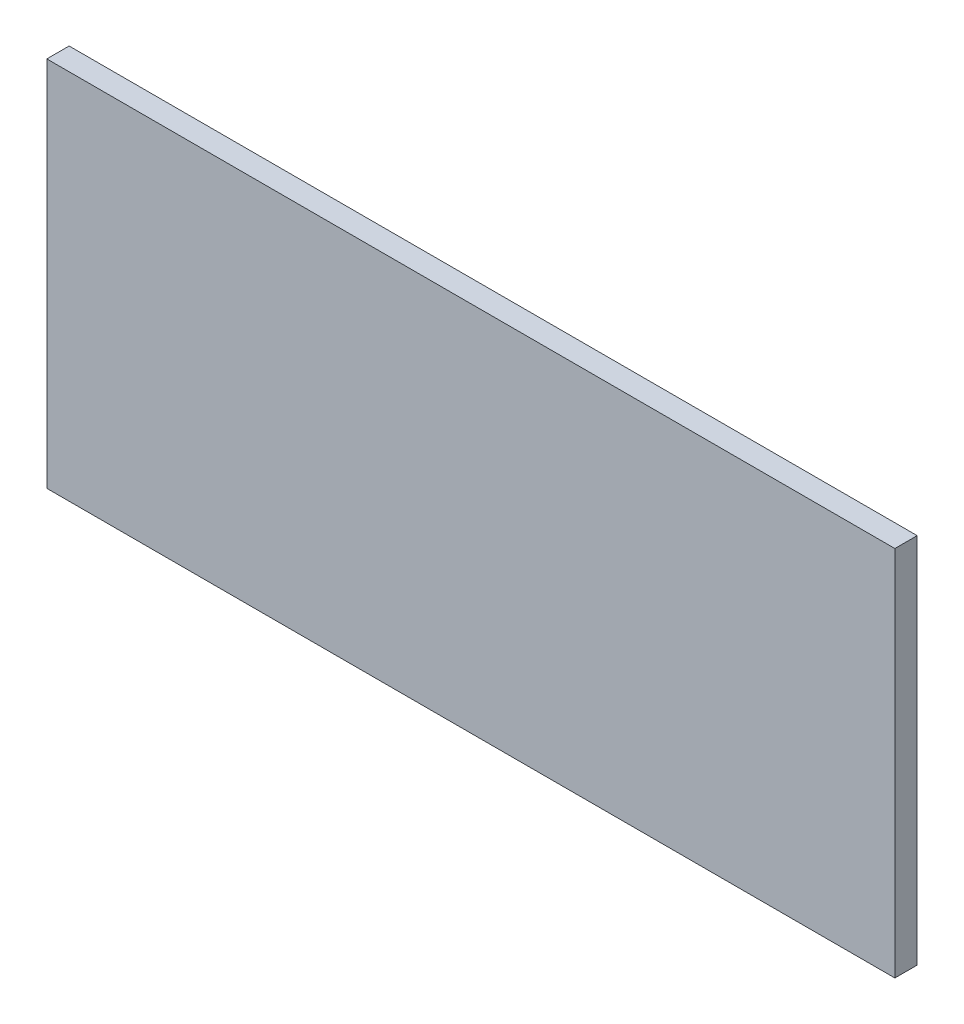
ISO-10303-21;
HEADER;
FILE_DESCRIPTION(('STEP AP214'),'2;1');
FILE_NAME('part.step','',(''),(''),'','','');
FILE_SCHEMA(('AUTOMOTIVE_DESIGN { 1 0 10303 214 1 1 1 1 }'));
ENDSEC;
DATA;
#1=APPLICATION_CONTEXT('core data for automotive mechanical design processes');
#2=APPLICATION_PROTOCOL_DEFINITION('international standard','automotive_design',2000,#1);
#3=PRODUCT_CONTEXT('',#1,'mechanical');
#4=PRODUCT('Part','Part','',(#3));
#5=PRODUCT_RELATED_PRODUCT_CATEGORY('part','',(#4));
#6=PRODUCT_DEFINITION_FORMATION('','',#4);
#7=PRODUCT_DEFINITION_CONTEXT('part definition',#1,'design');
#8=PRODUCT_DEFINITION('design','',#6,#7);
#9=PRODUCT_DEFINITION_SHAPE('','',#8);
#10=(LENGTH_UNIT() NAMED_UNIT(*) SI_UNIT(.MILLI.,.METRE.));
#11=(NAMED_UNIT(*) PLANE_ANGLE_UNIT() SI_UNIT($,.RADIAN.));
#12=(NAMED_UNIT(*) SI_UNIT($,.STERADIAN.) SOLID_ANGLE_UNIT());
#13=UNCERTAINTY_MEASURE_WITH_UNIT(LENGTH_MEASURE(1.E-05),#10,'distance_accuracy_value','');
#14=(GEOMETRIC_REPRESENTATION_CONTEXT(3) GLOBAL_UNCERTAINTY_ASSIGNED_CONTEXT((#13)) GLOBAL_UNIT_ASSIGNED_CONTEXT((#10,
#11,#12)) REPRESENTATION_CONTEXT('',''));
#15=CARTESIAN_POINT('',(0.,0.,0.));
#16=DIRECTION('',(0.,0.,1.));
#17=DIRECTION('',(1.,0.,0.));
#18=AXIS2_PLACEMENT_3D('',#15,#16,#17);
#19=CARTESIAN_POINT('',(-1.4478,-0.635,0.));
#20=DIRECTION('',(0.,0.,1.));
#21=DIRECTION('',(1.,0.,0.));
#22=AXIS2_PLACEMENT_3D('',#19,#20,#21);
#23=PLANE('',#22);
#24=DIRECTION('',(-1.,0.,0.));
#25=VECTOR('',#24,1.);
#26=CARTESIAN_POINT('',(0.,0.635,0.));
#27=LINE('',#26,#25);
#28=CARTESIAN_POINT('',(1.4478,0.635,0.));
#29=VERTEX_POINT('',#28);
#30=CARTESIAN_POINT('',(-1.4478,0.635,0.));
#31=VERTEX_POINT('',#30);
#32=EDGE_CURVE('E56',#29,#31,#27,.T.);
#33=ORIENTED_EDGE('',*,*,#32,.F.);
#34=DIRECTION('',(0.,1.,0.));
#35=VECTOR('',#34,1.);
#36=CARTESIAN_POINT('',(1.4478,0.,0.));
#37=LINE('',#36,#35);
#38=CARTESIAN_POINT('',(1.4478,-0.635,0.));
#39=VERTEX_POINT('',#38);
#40=EDGE_CURVE('E59',#39,#29,#37,.T.);
#41=ORIENTED_EDGE('',*,*,#40,.F.);
#42=DIRECTION('',(1.,0.,0.));
#43=VECTOR('',#42,1.);
#44=CARTESIAN_POINT('',(0.,-0.635,0.));
#45=LINE('',#44,#43);
#46=CARTESIAN_POINT('',(-1.4478,-0.635,0.));
#47=VERTEX_POINT('',#46);
#48=EDGE_CURVE('E21',#47,#39,#45,.T.);
#49=ORIENTED_EDGE('',*,*,#48,.F.);
#50=DIRECTION('',(0.,-1.,0.));
#51=VECTOR('',#50,1.);
#52=CARTESIAN_POINT('',(-1.4478,0.,0.));
#53=LINE('',#52,#51);
#54=EDGE_CURVE('E71',#31,#47,#53,.T.);
#55=ORIENTED_EDGE('',*,*,#54,.F.);
#56=EDGE_LOOP('',(#33,#41,#49,#55));
#57=FACE_BOUND('',#56,.T.);
#58=ADVANCED_FACE('F17',(#57),#23,.F.);
#59=CARTESIAN_POINT('',(-1.4478,-0.635,0.0762));
#60=DIRECTION('',(0.,-1.,0.));
#61=DIRECTION('',(0.,0.,-1.));
#62=AXIS2_PLACEMENT_3D('',#59,#60,#61);
#63=PLANE('',#62);
#64=DIRECTION('',(0.,0.,1.));
#65=VECTOR('',#64,1.);
#66=CARTESIAN_POINT('',(-1.4478,-0.635,0.0381));
#67=LINE('',#66,#65);
#68=CARTESIAN_POINT('',(-1.4478,-0.635,0.0762));
#69=VERTEX_POINT('',#68);
#70=EDGE_CURVE('E70',#47,#69,#67,.T.);
#71=ORIENTED_EDGE('',*,*,#70,.F.);
#72=ORIENTED_EDGE('',*,*,#48,.T.);
#73=DIRECTION('',(0.,0.,-1.));
#74=VECTOR('',#73,1.);
#75=CARTESIAN_POINT('',(1.4478,-0.635,0.0381));
#76=LINE('',#75,#74);
#77=CARTESIAN_POINT('',(1.4478,-0.635,0.0762));
#78=VERTEX_POINT('',#77);
#79=EDGE_CURVE('E65',#78,#39,#76,.T.);
#80=ORIENTED_EDGE('',*,*,#79,.F.);
#81=DIRECTION('',(1.,0.,0.));
#82=VECTOR('',#81,1.);
#83=CARTESIAN_POINT('',(0.,-0.635,0.0762));
#84=LINE('',#83,#82);
#85=EDGE_CURVE('E83',#69,#78,#84,.T.);
#86=ORIENTED_EDGE('',*,*,#85,.F.);
#87=EDGE_LOOP('',(#71,#72,#80,#86));
#88=FACE_BOUND('',#87,.T.);
#89=ADVANCED_FACE('F67',(#88),#63,.T.);
#90=CARTESIAN_POINT('',(1.4478,-0.635,0.0762));
#91=DIRECTION('',(1.,0.,0.));
#92=DIRECTION('',(0.,0.,-1.));
#93=AXIS2_PLACEMENT_3D('',#90,#91,#92);
#94=PLANE('',#93);
#95=ORIENTED_EDGE('',*,*,#79,.T.);
#96=ORIENTED_EDGE('',*,*,#40,.T.);
#97=DIRECTION('',(0.,0.,-1.));
#98=VECTOR('',#97,1.);
#99=CARTESIAN_POINT('',(1.4478,0.635,0.0381));
#100=LINE('',#99,#98);
#101=CARTESIAN_POINT('',(1.4478,0.635,0.0762));
#102=VERTEX_POINT('',#101);
#103=EDGE_CURVE('E77',#102,#29,#100,.T.);
#104=ORIENTED_EDGE('',*,*,#103,.F.);
#105=DIRECTION('',(0.,1.,0.));
#106=VECTOR('',#105,1.);
#107=CARTESIAN_POINT('',(1.4478,0.,0.0762));
#108=LINE('',#107,#106);
#109=EDGE_CURVE('E74',#78,#102,#108,.T.);
#110=ORIENTED_EDGE('',*,*,#109,.F.);
#111=EDGE_LOOP('',(#95,#96,#104,#110));
#112=FACE_BOUND('',#111,.T.);
#113=ADVANCED_FACE('F72',(#112),#94,.T.);
#114=CARTESIAN_POINT('',(1.4478,0.635,0.0762));
#115=DIRECTION('',(0.,1.,0.));
#116=DIRECTION('',(0.,0.,-1.));
#117=AXIS2_PLACEMENT_3D('',#114,#115,#116);
#118=PLANE('',#117);
#119=ORIENTED_EDGE('',*,*,#103,.T.);
#120=ORIENTED_EDGE('',*,*,#32,.T.);
#121=DIRECTION('',(0.,0.,-1.));
#122=VECTOR('',#121,1.);
#123=CARTESIAN_POINT('',(-1.4478,0.635,0.0381));
#124=LINE('',#123,#122);
#125=CARTESIAN_POINT('',(-1.4478,0.635,0.0762));
#126=VERTEX_POINT('',#125);
#127=EDGE_CURVE('E36',#126,#31,#124,.T.);
#128=ORIENTED_EDGE('',*,*,#127,.F.);
#129=DIRECTION('',(-1.,0.,0.));
#130=VECTOR('',#129,1.);
#131=CARTESIAN_POINT('',(0.,0.635,0.0762));
#132=LINE('',#131,#130);
#133=EDGE_CURVE('E27',#102,#126,#132,.T.);
#134=ORIENTED_EDGE('',*,*,#133,.F.);
#135=EDGE_LOOP('',(#119,#120,#128,#134));
#136=FACE_BOUND('',#135,.T.);
#137=ADVANCED_FACE('F89',(#136),#118,.T.);
#138=CARTESIAN_POINT('',(-1.4478,0.635,0.0762));
#139=DIRECTION('',(-1.,0.,0.));
#140=DIRECTION('',(0.,0.,-1.));
#141=AXIS2_PLACEMENT_3D('',#138,#139,#140);
#142=PLANE('',#141);
#143=ORIENTED_EDGE('',*,*,#127,.T.);
#144=ORIENTED_EDGE('',*,*,#54,.T.);
#145=ORIENTED_EDGE('',*,*,#70,.T.);
#146=DIRECTION('',(0.,-1.,0.));
#147=VECTOR('',#146,1.);
#148=CARTESIAN_POINT('',(-1.4478,0.,0.0762));
#149=LINE('',#148,#147);
#150=EDGE_CURVE('E11',#126,#69,#149,.T.);
#151=ORIENTED_EDGE('',*,*,#150,.F.);
#152=EDGE_LOOP('',(#143,#144,#145,#151));
#153=FACE_BOUND('',#152,.T.);
#154=ADVANCED_FACE('F91',(#153),#142,.T.);
#155=CARTESIAN_POINT('',(-1.4478,-0.635,0.0762));
#156=DIRECTION('',(0.,0.,1.));
#157=DIRECTION('',(1.,0.,0.));
#158=AXIS2_PLACEMENT_3D('',#155,#156,#157);
#159=PLANE('',#158);
#160=ORIENTED_EDGE('',*,*,#133,.T.);
#161=ORIENTED_EDGE('',*,*,#150,.T.);
#162=ORIENTED_EDGE('',*,*,#85,.T.);
#163=ORIENTED_EDGE('',*,*,#109,.T.);
#164=EDGE_LOOP('',(#160,#161,#162,#163));
#165=FACE_BOUND('',#164,.T.);
#166=ADVANCED_FACE('F19',(#165),#159,.T.);
#167=CLOSED_SHELL('',(#58,#89,#113,#137,#154,#166));
#168=MANIFOLD_SOLID_BREP('B1',#167);
#169=ADVANCED_BREP_SHAPE_REPRESENTATION('',(#18,#168),#14);
#170=SHAPE_DEFINITION_REPRESENTATION(#9,#169);
ENDSEC;
END-ISO-10303-21;
